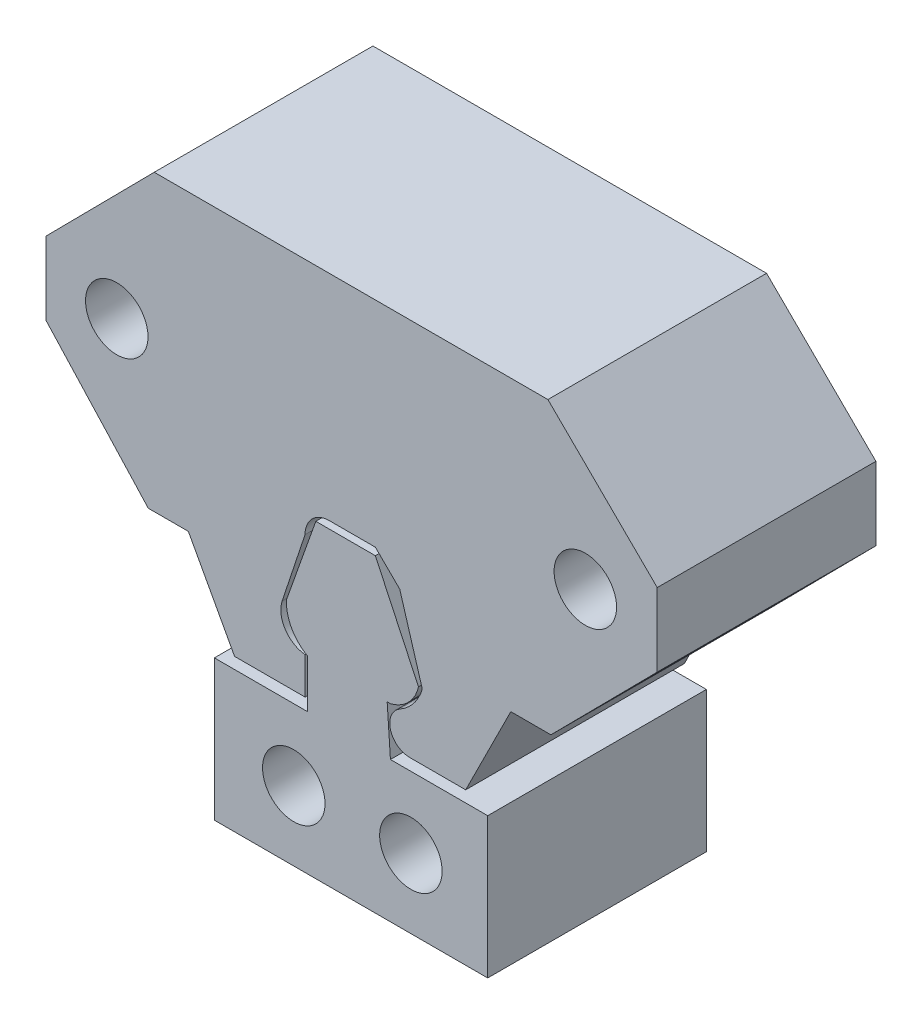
from build123d import *

# Parameters (mm, degrees)
SKETCH1_R             = 4
BOSS_EXTRUDE1_DEPTH   = 28
BOSS_EXTRUDE1_2_DEPTH = 28


with BuildPart() as part:
    # Sketch1 → Boss-Extrude1 (new body)
    with BuildSketch(Plane.XY):
        with BuildLine():
            Line((186.746457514, 212.776665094), (200.746457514, 198.927124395))
            Line((200.746457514, 198.927124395), (200.746457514, 189.555890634))
            Line((200.746457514, 189.555890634), (187.130080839, 175.791587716))
            Line((187.130080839, 175.791587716), (181.996754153, 175.791587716))
            Line((181.996754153, 175.791587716), (176.220729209, 164.23386158))
            Line((176.220729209, 164.23386158), (169.028852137, 164.23386158))
            ThreePointArc((169.028852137, 164.23386158), (166.582030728, 166.115297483), (167.771821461, 168.963302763))
            ThreePointArc((167.771821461, 168.963302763), (169.572243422, 170.513740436), (170.663369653, 172.624384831))
            Line((170.663369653, 172.624384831), (167.771821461, 182.270281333))
            Line((167.771821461, 182.270281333), (164.653484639, 185.3551051))
            Line((164.653484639, 185.3551051), (158.754258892, 185.3551051))
            ThreePointArc((158.754258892, 185.3551051), (156.560388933, 184.446576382), (155.651170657, 182.25299211))
            Line((155.651170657, 182.25299211), (152.7199301, 173.425301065))
            ThreePointArc((152.7199301, 173.425301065), (153.107861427, 170.471135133), (155.666645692, 168.944632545))
            Line((155.666645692, 168.944632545), (155.666645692, 164.23386158))
            Line((155.666645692, 164.23386158), (154.202749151, 164.23386158))
            Line((154.202749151, 164.23386158), (146.627618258, 164.23386158))
            Line((146.627618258, 164.23386158), (140.709053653, 175.135131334))
            Line((140.709053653, 175.135131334), (135.575726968, 175.135131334))
            Line((135.575726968, 175.135131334), (122.490609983, 189.405431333))
            Line((122.490609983, 189.405431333), (122.490609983, 198.776665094))
            Line((122.490609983, 198.776665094), (136.340150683, 212.776665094))
            Line((136.340150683, 212.776665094), (186.746457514, 212.776665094))
        make_face()
        with Locations((131.539430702, 194.135131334)):
            Circle(SKETCH1_R, mode=Mode.SUBTRACT)
        with Locations((191.539430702, 194.135131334)):
            Circle(SKETCH1_R, mode=Mode.SUBTRACT)
    extrude(amount=BOSS_EXTRUDE1_DEPTH)


with BuildPart() as body_2:
    # Sketch1 → Boss-Extrude1 2 (new body)
    with BuildSketch(Plane.XY):
        with BuildLine():
            Line((155.666645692, 162.776665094), (144.039430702, 162.776665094))
            Line((144.039430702, 162.776665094), (144.039430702, 144.776665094))
            Line((144.039430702, 144.776665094), (179.039430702, 144.776665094))
            Line((179.039430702, 144.776665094), (179.039430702, 162.776665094))
            Line((179.039430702, 162.776665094), (166.582030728, 162.776665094))
            Line((166.582030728, 162.776665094), (166.164729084, 168.963302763))
            Line((166.164729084, 168.963302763), (166.582030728, 168.963302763))
            ThreePointArc((166.582030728, 168.963302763), (168.894885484, 170.286935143), (170.17458418, 172.624384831))
            Line((170.17458418, 172.624384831), (164.653484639, 184.413145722))
            Line((164.653484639, 184.413145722), (157.025989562, 184.413145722))
            Line((157.025989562, 184.413145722), (153.263512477, 173.817984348))
            ThreePointArc((153.263512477, 173.817984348), (153.929619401, 171.002783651), (155.962614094, 168.944632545))
            Line((155.962614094, 168.944632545), (155.962614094, 162.776665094))
            Line((155.962614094, 162.776665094), (155.666645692, 162.776665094))
        make_face()
        with Locations((154.202749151, 153.686779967)):
            Circle(SKETCH1_R, mode=Mode.SUBTRACT)
        with Locations((169.202749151, 153.686779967)):
            Circle(SKETCH1_R, mode=Mode.SUBTRACT)
    extrude(amount=BOSS_EXTRUDE1_2_DEPTH)


solid = Compound([part.part, body_2.part])
